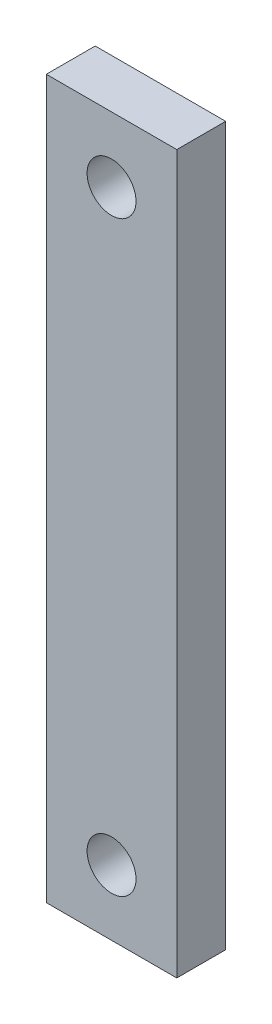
from build123d import *

# Parameters (mm, degrees)
ESQUISSE1_W      = 8
ESQUISSE1_H      = 44
ESQUISSE1_R      = 1.5
EXTRUSION1_DEPTH = 3


with BuildPart() as part:
    # Esquisse1 → Extrusion1 (new body)
    with BuildSketch(Plane.XY):
        with Locations((0, 18)):
            Rectangle(ESQUISSE1_W, ESQUISSE1_H)
        Circle(ESQUISSE1_R, mode=Mode.SUBTRACT)
        with Locations((0, 36)):
            Circle(ESQUISSE1_R, mode=Mode.SUBTRACT)
    extrude(amount=EXTRUSION1_DEPTH)


solid = part.part
